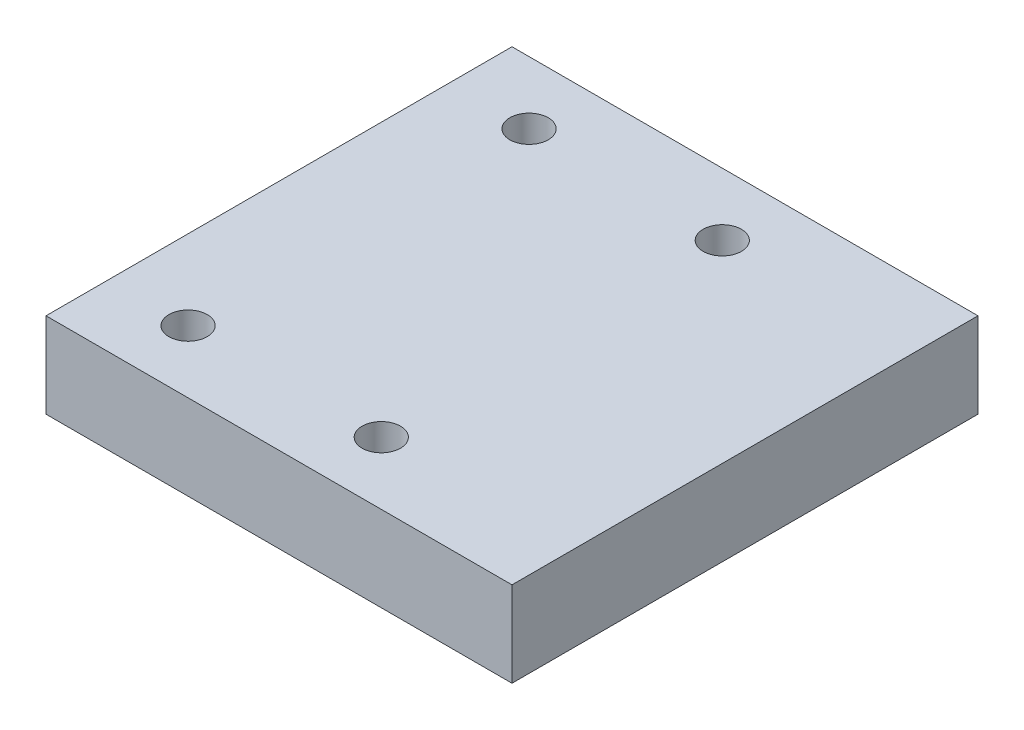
from build123d import *

# Parameters (mm, degrees)
ESQUISSE1_W             = 82
ESQUISSE1_H             = 15
EXTRUSION1_DEPTH        = 41
ESQUISSE2_R             = 3.375
ENL_V_MAT_EXTRU_1_DEPTH = 60.891568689


with BuildPart() as part:
    # Esquisse1 → Extrusion1 (new, symmetric)
    with BuildSketch(Plane.XY):
        with Locations((0, 7.5)):
            Rectangle(ESQUISSE1_W, ESQUISSE1_H)
    extrude(amount=EXTRUSION1_DEPTH, both=True)

    # Esquisse2 → Enl_v. mat.-Extru.1 (cut, through all)
    with BuildSketch(Plane(origin=(0, 15, 0), x_dir=(1, 0, 0), z_dir=(0, 1, 0))):
        with Locations(Location((-27, 30, 0), (0, 0, 270))):
            Circle(ESQUISSE2_R)
        with Locations(Location((7, 30, 0), (0, 0, 90))):
            Circle(ESQUISSE2_R)
        with Locations(Location((7, -30, 0), (0, 0, 270))):
            Circle(ESQUISSE2_R)
        with Locations(Location((-27, -30, 0), (0, 0, 90))):
            Circle(ESQUISSE2_R)
    extrude(amount=-ENL_V_MAT_EXTRU_1_DEPTH, mode=Mode.SUBTRACT)


solid = part.part
